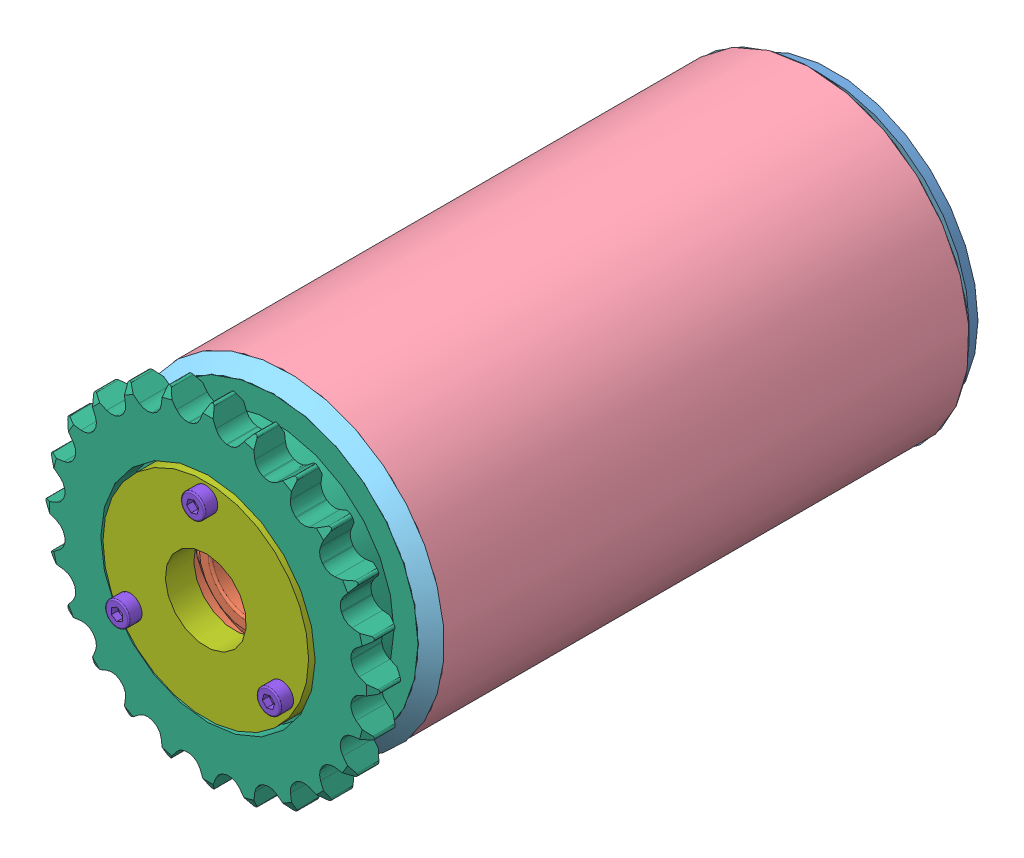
SolidWorks assembly ENSEMBLE MOBILE.SLDASM, configuration Défaut (file format 3100). Lengths in mm.
Overall size (94.9 94.9 150).
15 component instances, 8 part files, 0 mates.
Components (placement in the parent):
- flasque-1: flasque.SLDPRT [Défaut] at origin size (66 66 26)
- Roulement type BC 17x35x10-1: Roulement type BC 17x35x10.Sldprt [Défaut] at (0 0 19) x (0 0 -1) z (1 0 0) size (10 35 35)
- couvercle flasque-1: couvercle flasque.SLDPRT [Défaut] at (0 0 -0.5) size (47 47 9.5)
- rouleau-1: rouleau.SLDPRT [Défaut] at (0 0 5) x (-0.915326 0.402714 0) z (0 0 1) size (72 72 120)
- cordon de soudure-1: cordon de soudure.SLDPRT [Défaut] at (0 0 34.1995) x (0 0 1) z (-1 0 0) size (3 72 72)
- flasque_denté-1: flasque_denté.SLDPRT [Défaut] at (0 0 143) x (-1 0 0) z (0 0 -1) size (76.36 76.36 26)
- Roulement type BC 17x35x10-2: Roulement type BC 17x35x10.Sldprt [Défaut] at (0 0 124) x (0 0 1) z (-1 0 0) size (10 35 35)
- cordon de soudure-2: cordon de soudure.SLDPRT [Défaut] at (0 0 95.8005) x (0 0 -1) z (1 0 0) size (3 72 72)
- couvercle pour flasque denté-1: couvercle pour flasque denté.SLDPRT [Défaut] at (0 0 143.5) x (0.5 0.866025 0) z (0 0 -1) size (47 47 9.5)
- Vis C HC, M 3x12-1: Vis C HC, M 3x12.Sldprt [Défaut] at (17.3205 -10 143.5) x (0.968879 0.247535 0) z (0.247535 -0.968879 0) size (5.5 15 5.5)
- Vis C HC, M 3x12-2: Vis C HC, M 3x12.Sldprt [Défaut] at (-17.3205 -10 143.5) x (0.877462 0.479646 0) z (0.479646 -0.877462 0) size (5.5 15 5.5)
- Vis C HC, M 3x12-3: Vis C HC, M 3x12.Sldprt [Défaut] at (0 20 143.5) x (0.956953 0.290243 0) z (0.290243 -0.956953 0) size (5.5 15 5.5)
- Vis C HC, M 3x12-4: Vis C HC, M 3x12.Sldprt [Défaut] at (-17.3205 -10 -0.5) x (0.212681 -0.977122 0) z (0.977122 0.212681 0) size (5.5 15 5.5)
- Vis C HC, M 3x12-5: Vis C HC, M 3x12.Sldprt [Défaut] at (0 20 -0.5) x (0.389055 -0.921215 0) z (0.921215 0.389055 0) size (5.5 15 5.5)
- Vis C HC, M 3x12-6: Vis C HC, M 3x12.Sldprt [Défaut] at (17.3205 -10 -0.5) x (0.354174 -0.93518 0) z (0.93518 0.354174 0) size (5.5 15 5.5)
